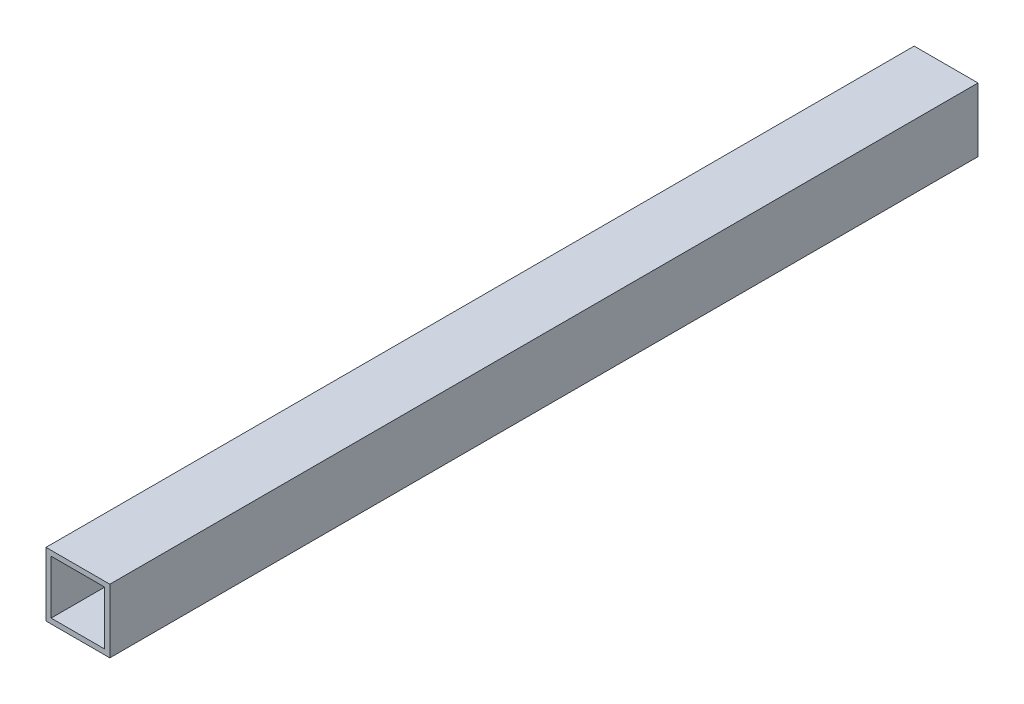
ISO-10303-21;
HEADER;
FILE_DESCRIPTION(('STEP AP214'),'2;1');
FILE_NAME('part.step','',(''),(''),'','','');
FILE_SCHEMA(('AUTOMOTIVE_DESIGN { 1 0 10303 214 1 1 1 1 }'));
ENDSEC;
DATA;
#1=APPLICATION_CONTEXT('core data for automotive mechanical design processes');
#2=APPLICATION_PROTOCOL_DEFINITION('international standard','automotive_design',2000,#1);
#3=PRODUCT_CONTEXT('',#1,'mechanical');
#4=PRODUCT('Part','Part','',(#3));
#5=PRODUCT_RELATED_PRODUCT_CATEGORY('part','',(#4));
#6=PRODUCT_DEFINITION_FORMATION('','',#4);
#7=PRODUCT_DEFINITION_CONTEXT('part definition',#1,'design');
#8=PRODUCT_DEFINITION('design','',#6,#7);
#9=PRODUCT_DEFINITION_SHAPE('','',#8);
#10=(LENGTH_UNIT() NAMED_UNIT(*) SI_UNIT(.MILLI.,.METRE.));
#11=(NAMED_UNIT(*) PLANE_ANGLE_UNIT() SI_UNIT($,.RADIAN.));
#12=(NAMED_UNIT(*) SI_UNIT($,.STERADIAN.) SOLID_ANGLE_UNIT());
#13=UNCERTAINTY_MEASURE_WITH_UNIT(LENGTH_MEASURE(1.E-05),#10,'distance_accuracy_value','');
#14=(GEOMETRIC_REPRESENTATION_CONTEXT(3) GLOBAL_UNCERTAINTY_ASSIGNED_CONTEXT((#13)) GLOBAL_UNIT_ASSIGNED_CONTEXT((#10,
#11,#12)) REPRESENTATION_CONTEXT('',''));
#15=CARTESIAN_POINT('',(0.,0.,0.));
#16=DIRECTION('',(0.,0.,1.));
#17=DIRECTION('',(1.,0.,0.));
#18=AXIS2_PLACEMENT_3D('',#15,#16,#17);
#19=CARTESIAN_POINT('',(0.,0.,340.));
#20=DIRECTION('',(1.,0.,0.));
#21=DIRECTION('',(0.,0.,-1.));
#22=AXIS2_PLACEMENT_3D('',#19,#20,#21);
#23=PLANE('',#22);
#24=DIRECTION('',(0.,-1.,0.));
#25=VECTOR('',#24,1.);
#26=CARTESIAN_POINT('',(0.,0.,0.));
#27=LINE('',#26,#25);
#28=CARTESIAN_POINT('',(0.,25.,0.));
#29=VERTEX_POINT('',#28);
#30=CARTESIAN_POINT('',(0.,0.,0.));
#31=VERTEX_POINT('',#30);
#32=EDGE_CURVE('E138',#29,#31,#27,.T.);
#33=ORIENTED_EDGE('',*,*,#32,.T.);
#34=DIRECTION('',(0.,0.,-1.));
#35=VECTOR('',#34,1.);
#36=CARTESIAN_POINT('',(0.,0.,340.));
#37=LINE('',#36,#35);
#38=CARTESIAN_POINT('',(0.,0.,340.));
#39=VERTEX_POINT('',#38);
#40=EDGE_CURVE('E11',#39,#31,#37,.T.);
#41=ORIENTED_EDGE('',*,*,#40,.F.);
#42=DIRECTION('',(0.,-1.,0.));
#43=VECTOR('',#42,1.);
#44=CARTESIAN_POINT('',(0.,0.,340.));
#45=LINE('',#44,#43);
#46=CARTESIAN_POINT('',(0.,25.,340.));
#47=VERTEX_POINT('',#46);
#48=EDGE_CURVE('E142',#47,#39,#45,.T.);
#49=ORIENTED_EDGE('',*,*,#48,.F.);
#50=DIRECTION('',(0.,0.,-1.));
#51=VECTOR('',#50,1.);
#52=CARTESIAN_POINT('',(0.,25.,340.));
#53=LINE('',#52,#51);
#54=EDGE_CURVE('E152',#47,#29,#53,.T.);
#55=ORIENTED_EDGE('',*,*,#54,.T.);
#56=EDGE_LOOP('',(#33,#41,#49,#55));
#57=FACE_BOUND('',#56,.T.);
#58=ADVANCED_FACE('F41',(#57),#23,.F.);
#59=CARTESIAN_POINT('',(0.,0.,340.));
#60=DIRECTION('',(0.,1.,0.));
#61=DIRECTION('',(0.,0.,1.));
#62=AXIS2_PLACEMENT_3D('',#59,#60,#61);
#63=PLANE('',#62);
#64=DIRECTION('',(1.,0.,0.));
#65=VECTOR('',#64,1.);
#66=CARTESIAN_POINT('',(0.,0.,0.));
#67=LINE('',#66,#65);
#68=CARTESIAN_POINT('',(25.,0.,0.));
#69=VERTEX_POINT('',#68);
#70=EDGE_CURVE('E155',#31,#69,#67,.T.);
#71=ORIENTED_EDGE('',*,*,#70,.T.);
#72=DIRECTION('',(0.,0.,-1.));
#73=VECTOR('',#72,1.);
#74=CARTESIAN_POINT('',(25.,0.,340.));
#75=LINE('',#74,#73);
#76=CARTESIAN_POINT('',(25.,0.,340.));
#77=VERTEX_POINT('',#76);
#78=EDGE_CURVE('E48',#77,#69,#75,.T.);
#79=ORIENTED_EDGE('',*,*,#78,.F.);
#80=DIRECTION('',(1.,0.,0.));
#81=VECTOR('',#80,1.);
#82=CARTESIAN_POINT('',(0.,0.,340.));
#83=LINE('',#82,#81);
#84=EDGE_CURVE('E145',#39,#77,#83,.T.);
#85=ORIENTED_EDGE('',*,*,#84,.F.);
#86=ORIENTED_EDGE('',*,*,#40,.T.);
#87=EDGE_LOOP('',(#71,#79,#85,#86));
#88=FACE_BOUND('',#87,.T.);
#89=ADVANCED_FACE('F183',(#88),#63,.F.);
#90=CARTESIAN_POINT('',(25.,0.,340.));
#91=DIRECTION('',(-1.,0.,0.));
#92=DIRECTION('',(0.,0.,1.));
#93=AXIS2_PLACEMENT_3D('',#90,#91,#92);
#94=PLANE('',#93);
#95=DIRECTION('',(0.,1.,0.));
#96=VECTOR('',#95,1.);
#97=CARTESIAN_POINT('',(25.,0.,0.));
#98=LINE('',#97,#96);
#99=CARTESIAN_POINT('',(25.,25.,0.));
#100=VERTEX_POINT('',#99);
#101=EDGE_CURVE('E157',#69,#100,#98,.T.);
#102=ORIENTED_EDGE('',*,*,#101,.T.);
#103=DIRECTION('',(0.,0.,-1.));
#104=VECTOR('',#103,1.);
#105=CARTESIAN_POINT('',(25.,25.,340.));
#106=LINE('',#105,#104);
#107=CARTESIAN_POINT('',(25.,25.,340.));
#108=VERTEX_POINT('',#107);
#109=EDGE_CURVE('E162',#108,#100,#106,.T.);
#110=ORIENTED_EDGE('',*,*,#109,.F.);
#111=DIRECTION('',(0.,1.,0.));
#112=VECTOR('',#111,1.);
#113=CARTESIAN_POINT('',(25.,0.,340.));
#114=LINE('',#113,#112);
#115=EDGE_CURVE('E148',#77,#108,#114,.T.);
#116=ORIENTED_EDGE('',*,*,#115,.F.);
#117=ORIENTED_EDGE('',*,*,#78,.T.);
#118=EDGE_LOOP('',(#102,#110,#116,#117));
#119=FACE_BOUND('',#118,.T.);
#120=ADVANCED_FACE('F169',(#119),#94,.F.);
#121=CARTESIAN_POINT('',(0.,25.,340.));
#122=DIRECTION('',(0.,-1.,0.));
#123=DIRECTION('',(0.,0.,-1.));
#124=AXIS2_PLACEMENT_3D('',#121,#122,#123);
#125=PLANE('',#124);
#126=DIRECTION('',(-1.,0.,0.));
#127=VECTOR('',#126,1.);
#128=CARTESIAN_POINT('',(0.,25.,0.));
#129=LINE('',#128,#127);
#130=EDGE_CURVE('E146',#100,#29,#129,.T.);
#131=ORIENTED_EDGE('',*,*,#130,.T.);
#132=ORIENTED_EDGE('',*,*,#54,.F.);
#133=DIRECTION('',(-1.,0.,0.));
#134=VECTOR('',#133,1.);
#135=CARTESIAN_POINT('',(0.,25.,340.));
#136=LINE('',#135,#134);
#137=EDGE_CURVE('E150',#108,#47,#136,.T.);
#138=ORIENTED_EDGE('',*,*,#137,.F.);
#139=ORIENTED_EDGE('',*,*,#109,.T.);
#140=EDGE_LOOP('',(#131,#132,#138,#139));
#141=FACE_BOUND('',#140,.T.);
#142=ADVANCED_FACE('F176',(#141),#125,.F.);
#143=CARTESIAN_POINT('',(0.,0.,340.));
#144=DIRECTION('',(0.,0.,-1.));
#145=DIRECTION('',(-1.,0.,0.));
#146=AXIS2_PLACEMENT_3D('',#143,#144,#145);
#147=PLANE('',#146);
#148=DIRECTION('',(1.,0.,0.));
#149=VECTOR('',#148,1.);
#150=CARTESIAN_POINT('',(2.,2.,340.));
#151=LINE('',#150,#149);
#152=CARTESIAN_POINT('',(2.,2.,340.));
#153=VERTEX_POINT('',#152);
#154=CARTESIAN_POINT('',(23.,2.,340.));
#155=VERTEX_POINT('',#154);
#156=EDGE_CURVE('E132',#153,#155,#151,.T.);
#157=ORIENTED_EDGE('',*,*,#156,.F.);
#158=DIRECTION('',(0.,-1.,0.));
#159=VECTOR('',#158,1.);
#160=CARTESIAN_POINT('',(2.,2.,340.));
#161=LINE('',#160,#159);
#162=CARTESIAN_POINT('',(2.,23.,340.));
#163=VERTEX_POINT('',#162);
#164=EDGE_CURVE('E55',#163,#153,#161,.T.);
#165=ORIENTED_EDGE('',*,*,#164,.F.);
#166=DIRECTION('',(-1.,0.,0.));
#167=VECTOR('',#166,1.);
#168=CARTESIAN_POINT('',(2.,23.,340.));
#169=LINE('',#168,#167);
#170=CARTESIAN_POINT('',(23.,23.,340.));
#171=VERTEX_POINT('',#170);
#172=EDGE_CURVE('E123',#171,#163,#169,.T.);
#173=ORIENTED_EDGE('',*,*,#172,.F.);
#174=DIRECTION('',(0.,1.,0.));
#175=VECTOR('',#174,1.);
#176=CARTESIAN_POINT('',(23.,2.,340.));
#177=LINE('',#176,#175);
#178=EDGE_CURVE('E126',#155,#171,#177,.T.);
#179=ORIENTED_EDGE('',*,*,#178,.F.);
#180=EDGE_LOOP('',(#157,#165,#173,#179));
#181=FACE_BOUND('',#180,.T.);
#182=ORIENTED_EDGE('',*,*,#48,.T.);
#183=ORIENTED_EDGE('',*,*,#84,.T.);
#184=ORIENTED_EDGE('',*,*,#115,.T.);
#185=ORIENTED_EDGE('',*,*,#137,.T.);
#186=EDGE_LOOP('',(#182,#183,#184,#185));
#187=FACE_BOUND('',#186,.T.);
#188=ADVANCED_FACE('F182',(#181,#187),#147,.F.);
#189=CARTESIAN_POINT('',(0.,0.,0.));
#190=DIRECTION('',(0.,0.,-1.));
#191=DIRECTION('',(-1.,0.,0.));
#192=AXIS2_PLACEMENT_3D('',#189,#190,#191);
#193=PLANE('',#192);
#194=DIRECTION('',(0.,-1.,0.));
#195=VECTOR('',#194,1.);
#196=CARTESIAN_POINT('',(2.,2.,0.));
#197=LINE('',#196,#195);
#198=CARTESIAN_POINT('',(2.,23.,0.));
#199=VERTEX_POINT('',#198);
#200=CARTESIAN_POINT('',(2.,2.,0.));
#201=VERTEX_POINT('',#200);
#202=EDGE_CURVE('E107',#199,#201,#197,.T.);
#203=ORIENTED_EDGE('',*,*,#202,.T.);
#204=DIRECTION('',(1.,0.,0.));
#205=VECTOR('',#204,1.);
#206=CARTESIAN_POINT('',(2.,2.,0.));
#207=LINE('',#206,#205);
#208=CARTESIAN_POINT('',(23.,2.,0.));
#209=VERTEX_POINT('',#208);
#210=EDGE_CURVE('E116',#201,#209,#207,.T.);
#211=ORIENTED_EDGE('',*,*,#210,.T.);
#212=DIRECTION('',(0.,1.,0.));
#213=VECTOR('',#212,1.);
#214=CARTESIAN_POINT('',(23.,2.,0.));
#215=LINE('',#214,#213);
#216=CARTESIAN_POINT('',(23.,23.,0.));
#217=VERTEX_POINT('',#216);
#218=EDGE_CURVE('E63',#209,#217,#215,.T.);
#219=ORIENTED_EDGE('',*,*,#218,.T.);
#220=DIRECTION('',(-1.,0.,0.));
#221=VECTOR('',#220,1.);
#222=CARTESIAN_POINT('',(2.,23.,0.));
#223=LINE('',#222,#221);
#224=EDGE_CURVE('E113',#217,#199,#223,.T.);
#225=ORIENTED_EDGE('',*,*,#224,.T.);
#226=EDGE_LOOP('',(#203,#211,#219,#225));
#227=FACE_BOUND('',#226,.T.);
#228=ORIENTED_EDGE('',*,*,#32,.F.);
#229=ORIENTED_EDGE('',*,*,#130,.F.);
#230=ORIENTED_EDGE('',*,*,#101,.F.);
#231=ORIENTED_EDGE('',*,*,#70,.F.);
#232=EDGE_LOOP('',(#228,#229,#230,#231));
#233=FACE_BOUND('',#232,.T.);
#234=ADVANCED_FACE('F120',(#227,#233),#193,.T.);
#235=CARTESIAN_POINT('',(2.,2.,0.));
#236=DIRECTION('',(-1.,0.,0.));
#237=DIRECTION('',(0.,0.,1.));
#238=AXIS2_PLACEMENT_3D('',#235,#236,#237);
#239=PLANE('',#238);
#240=ORIENTED_EDGE('',*,*,#164,.T.);
#241=DIRECTION('',(0.,0.,1.));
#242=VECTOR('',#241,1.);
#243=CARTESIAN_POINT('',(2.,2.,0.));
#244=LINE('',#243,#242);
#245=EDGE_CURVE('E103',#201,#153,#244,.T.);
#246=ORIENTED_EDGE('',*,*,#245,.F.);
#247=ORIENTED_EDGE('',*,*,#202,.F.);
#248=DIRECTION('',(0.,0.,1.));
#249=VECTOR('',#248,1.);
#250=CARTESIAN_POINT('',(2.,23.,0.));
#251=LINE('',#250,#249);
#252=EDGE_CURVE('E136',#199,#163,#251,.T.);
#253=ORIENTED_EDGE('',*,*,#252,.T.);
#254=EDGE_LOOP('',(#240,#246,#247,#253));
#255=FACE_BOUND('',#254,.T.);
#256=ADVANCED_FACE('F105',(#255),#239,.F.);
#257=CARTESIAN_POINT('',(2.,23.,0.));
#258=DIRECTION('',(0.,1.,0.));
#259=DIRECTION('',(-1.,0.,0.));
#260=AXIS2_PLACEMENT_3D('',#257,#258,#259);
#261=PLANE('',#260);
#262=ORIENTED_EDGE('',*,*,#172,.T.);
#263=ORIENTED_EDGE('',*,*,#252,.F.);
#264=ORIENTED_EDGE('',*,*,#224,.F.);
#265=DIRECTION('',(0.,0.,1.));
#266=VECTOR('',#265,1.);
#267=CARTESIAN_POINT('',(23.,23.,0.));
#268=LINE('',#267,#266);
#269=EDGE_CURVE('E139',#217,#171,#268,.T.);
#270=ORIENTED_EDGE('',*,*,#269,.T.);
#271=EDGE_LOOP('',(#262,#263,#264,#270));
#272=FACE_BOUND('',#271,.T.);
#273=ADVANCED_FACE('F200',(#272),#261,.F.);
#274=CARTESIAN_POINT('',(23.,2.,0.));
#275=DIRECTION('',(1.,0.,0.));
#276=DIRECTION('',(0.,1.,0.));
#277=AXIS2_PLACEMENT_3D('',#274,#275,#276);
#278=PLANE('',#277);
#279=ORIENTED_EDGE('',*,*,#178,.T.);
#280=ORIENTED_EDGE('',*,*,#269,.F.);
#281=ORIENTED_EDGE('',*,*,#218,.F.);
#282=DIRECTION('',(0.,0.,1.));
#283=VECTOR('',#282,1.);
#284=CARTESIAN_POINT('',(23.,2.,0.));
#285=LINE('',#284,#283);
#286=EDGE_CURVE('E112',#209,#155,#285,.T.);
#287=ORIENTED_EDGE('',*,*,#286,.T.);
#288=EDGE_LOOP('',(#279,#280,#281,#287));
#289=FACE_BOUND('',#288,.T.);
#290=ADVANCED_FACE('F203',(#289),#278,.F.);
#291=CARTESIAN_POINT('',(2.,2.,0.));
#292=DIRECTION('',(0.,-1.,0.));
#293=DIRECTION('',(1.,0.,0.));
#294=AXIS2_PLACEMENT_3D('',#291,#292,#293);
#295=PLANE('',#294);
#296=ORIENTED_EDGE('',*,*,#156,.T.);
#297=ORIENTED_EDGE('',*,*,#286,.F.);
#298=ORIENTED_EDGE('',*,*,#210,.F.);
#299=ORIENTED_EDGE('',*,*,#245,.T.);
#300=EDGE_LOOP('',(#296,#297,#298,#299));
#301=FACE_BOUND('',#300,.T.);
#302=ADVANCED_FACE('F117',(#301),#295,.F.);
#303=CLOSED_SHELL('',(#58,#89,#120,#142,#188,#234,#256,#273,#290,#302));
#304=MANIFOLD_SOLID_BREP('B2',#303);
#305=ADVANCED_BREP_SHAPE_REPRESENTATION('',(#18,#304),#14);
#306=SHAPE_DEFINITION_REPRESENTATION(#9,#305);
ENDSEC;
END-ISO-10303-21;
